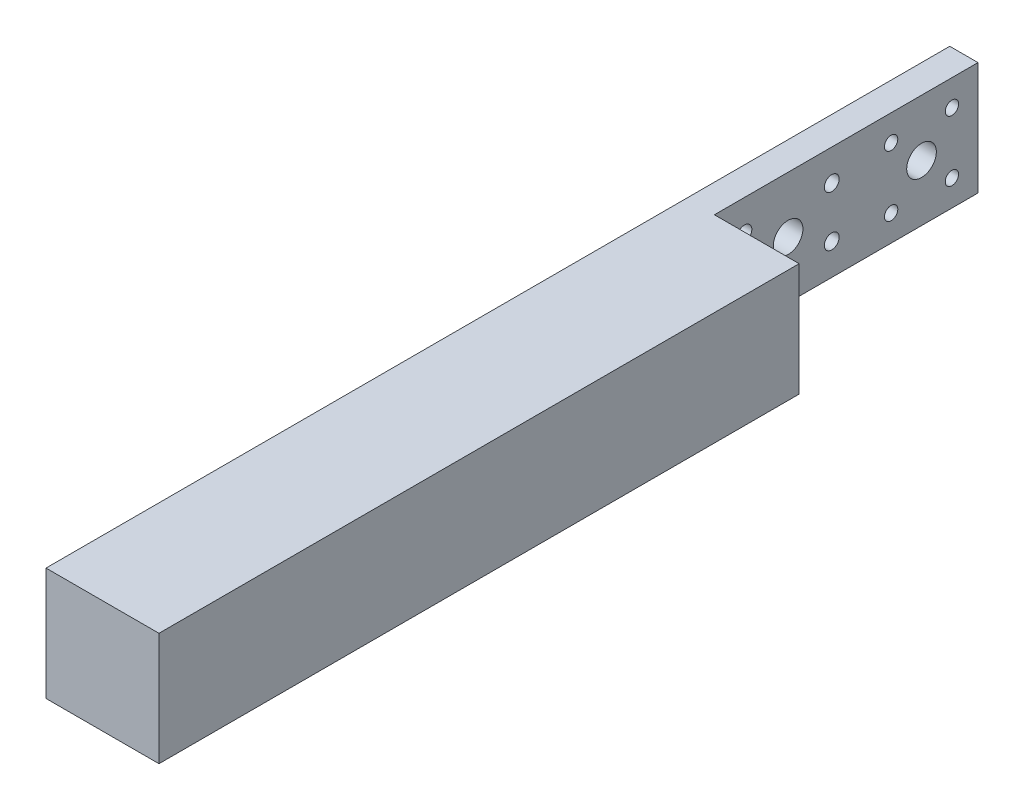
ISO-10303-21;
HEADER;
FILE_DESCRIPTION(('STEP AP214'),'2;1');
FILE_NAME('part.step','',(''),(''),'','','');
FILE_SCHEMA(('AUTOMOTIVE_DESIGN { 1 0 10303 214 1 1 1 1 }'));
ENDSEC;
DATA;
#1=APPLICATION_CONTEXT('core data for automotive mechanical design processes');
#2=APPLICATION_PROTOCOL_DEFINITION('international standard','automotive_design',2000,#1);
#3=PRODUCT_CONTEXT('',#1,'mechanical');
#4=PRODUCT('Part','Part','',(#3));
#5=PRODUCT_RELATED_PRODUCT_CATEGORY('part','',(#4));
#6=PRODUCT_DEFINITION_FORMATION('','',#4);
#7=PRODUCT_DEFINITION_CONTEXT('part definition',#1,'design');
#8=PRODUCT_DEFINITION('design','',#6,#7);
#9=PRODUCT_DEFINITION_SHAPE('','',#8);
#10=(LENGTH_UNIT() NAMED_UNIT(*) SI_UNIT(.MILLI.,.METRE.));
#11=(NAMED_UNIT(*) PLANE_ANGLE_UNIT() SI_UNIT($,.RADIAN.));
#12=(NAMED_UNIT(*) SI_UNIT($,.STERADIAN.) SOLID_ANGLE_UNIT());
#13=UNCERTAINTY_MEASURE_WITH_UNIT(LENGTH_MEASURE(1.E-05),#10,'distance_accuracy_value','');
#14=(GEOMETRIC_REPRESENTATION_CONTEXT(3) GLOBAL_UNCERTAINTY_ASSIGNED_CONTEXT((#13)) GLOBAL_UNIT_ASSIGNED_CONTEXT((#10,
#11,#12)) REPRESENTATION_CONTEXT('',''));
#15=CARTESIAN_POINT('',(0.,0.,0.));
#16=DIRECTION('',(0.,0.,1.));
#17=DIRECTION('',(1.,0.,0.));
#18=AXIS2_PLACEMENT_3D('',#15,#16,#17);
#19=CARTESIAN_POINT('',(19.05,19.05,304.8));
#20=DIRECTION('',(-1.,0.,0.));
#21=DIRECTION('',(0.,-1.,0.));
#22=AXIS2_PLACEMENT_3D('',#19,#20,#21);
#23=PLANE('',#22);
#24=DIRECTION('',(0.,0.,-1.));
#25=VECTOR('',#24,1.);
#26=CARTESIAN_POINT('',(19.05,-19.05,304.8));
#27=LINE('',#26,#25);
#28=CARTESIAN_POINT('',(19.05,-19.05,304.8));
#29=VERTEX_POINT('',#28);
#30=CARTESIAN_POINT('',(19.05,-19.05,88.9));
#31=VERTEX_POINT('',#30);
#32=EDGE_CURVE('E125',#29,#31,#27,.T.);
#33=ORIENTED_EDGE('',*,*,#32,.T.);
#34=DIRECTION('',(0.,-1.,0.));
#35=VECTOR('',#34,1.);
#36=CARTESIAN_POINT('',(19.05,19.05,88.9));
#37=LINE('',#36,#35);
#38=CARTESIAN_POINT('',(19.05,19.05,88.9));
#39=VERTEX_POINT('',#38);
#40=EDGE_CURVE('E105',#39,#31,#37,.T.);
#41=ORIENTED_EDGE('',*,*,#40,.F.);
#42=DIRECTION('',(0.,0.,-1.));
#43=VECTOR('',#42,1.);
#44=CARTESIAN_POINT('',(19.05,19.05,304.8));
#45=LINE('',#44,#43);
#46=CARTESIAN_POINT('',(19.05,19.05,304.8));
#47=VERTEX_POINT('',#46);
#48=EDGE_CURVE('E11',#47,#39,#45,.T.);
#49=ORIENTED_EDGE('',*,*,#48,.F.);
#50=DIRECTION('',(0.,1.,0.));
#51=VECTOR('',#50,1.);
#52=CARTESIAN_POINT('',(19.05,19.05,304.8));
#53=LINE('',#52,#51);
#54=EDGE_CURVE('E124',#29,#47,#53,.T.);
#55=ORIENTED_EDGE('',*,*,#54,.F.);
#56=EDGE_LOOP('',(#33,#41,#49,#55));
#57=FACE_BOUND('',#56,.T.);
#58=ADVANCED_FACE('F33',(#57),#23,.F.);
#59=CARTESIAN_POINT('',(-19.05,19.05,304.8));
#60=DIRECTION('',(0.,-1.,0.));
#61=DIRECTION('',(0.,0.,-1.));
#62=AXIS2_PLACEMENT_3D('',#59,#60,#61);
#63=PLANE('',#62);
#64=ORIENTED_EDGE('',*,*,#48,.T.);
#65=DIRECTION('',(1.,0.,0.));
#66=VECTOR('',#65,1.);
#67=CARTESIAN_POINT('',(-9.525,19.05,88.9));
#68=LINE('',#67,#66);
#69=CARTESIAN_POINT('',(-9.525,19.05,88.9));
#70=VERTEX_POINT('',#69);
#71=EDGE_CURVE('E109',#70,#39,#68,.T.);
#72=ORIENTED_EDGE('',*,*,#71,.F.);
#73=DIRECTION('',(0.,0.,1.));
#74=VECTOR('',#73,1.);
#75=CARTESIAN_POINT('',(-9.525,19.05,0.));
#76=LINE('',#75,#74);
#77=CARTESIAN_POINT('',(-9.525,19.05,0.));
#78=VERTEX_POINT('',#77);
#79=EDGE_CURVE('E99',#78,#70,#76,.T.);
#80=ORIENTED_EDGE('',*,*,#79,.F.);
#81=DIRECTION('',(-1.,0.,0.));
#82=VECTOR('',#81,1.);
#83=CARTESIAN_POINT('',(-19.05,19.05,0.));
#84=LINE('',#83,#82);
#85=CARTESIAN_POINT('',(-19.05,19.05,0.));
#86=VERTEX_POINT('',#85);
#87=EDGE_CURVE('E108',#78,#86,#84,.T.);
#88=ORIENTED_EDGE('',*,*,#87,.T.);
#89=DIRECTION('',(0.,0.,-1.));
#90=VECTOR('',#89,1.);
#91=CARTESIAN_POINT('',(-19.05,19.05,304.8));
#92=LINE('',#91,#90);
#93=CARTESIAN_POINT('',(-19.05,19.05,304.8));
#94=VERTEX_POINT('',#93);
#95=EDGE_CURVE('E41',#94,#86,#92,.T.);
#96=ORIENTED_EDGE('',*,*,#95,.F.);
#97=DIRECTION('',(-1.,0.,0.));
#98=VECTOR('',#97,1.);
#99=CARTESIAN_POINT('',(-19.05,19.05,304.8));
#100=LINE('',#99,#98);
#101=EDGE_CURVE('E80',#47,#94,#100,.T.);
#102=ORIENTED_EDGE('',*,*,#101,.F.);
#103=EDGE_LOOP('',(#64,#72,#80,#88,#96,#102));
#104=FACE_BOUND('',#103,.T.);
#105=ADVANCED_FACE('F107',(#104),#63,.F.);
#106=CARTESIAN_POINT('',(-19.05,19.05,304.8));
#107=DIRECTION('',(1.,0.,0.));
#108=DIRECTION('',(0.,1.,0.));
#109=AXIS2_PLACEMENT_3D('',#106,#107,#108);
#110=PLANE('',#109);
#111=CARTESIAN_POINT('',(-19.05,10.253048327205,8.79695167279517));
#112=DIRECTION('',(1.,0.,0.));
#113=DIRECTION('',(0.,0.,-1.));
#114=AXIS2_PLACEMENT_3D('',#111,#112,#113);
#115=CIRCLE('',#114,2.25);
#116=CARTESIAN_POINT('',(-19.05,10.2530483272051,6.54695167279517));
#117=VERTEX_POINT('',#116);
#118=EDGE_CURVE('E159',#117,#117,#115,.T.);
#119=ORIENTED_EDGE('',*,*,#118,.T.);
#120=EDGE_LOOP('',(#119));
#121=FACE_BOUND('',#120,.T.);
#122=CARTESIAN_POINT('',(-19.05,-10.2530483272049,8.79695167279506));
#123=DIRECTION('',(1.,0.,0.));
#124=DIRECTION('',(0.,-1.,0.));
#125=AXIS2_PLACEMENT_3D('',#122,#123,#124);
#126=CIRCLE('',#125,2.25);
#127=CARTESIAN_POINT('',(-19.05,-12.5030483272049,8.79695167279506));
#128=VERTEX_POINT('',#127);
#129=EDGE_CURVE('E156',#128,#128,#126,.T.);
#130=ORIENTED_EDGE('',*,*,#129,.T.);
#131=EDGE_LOOP('',(#130));
#132=FACE_BOUND('',#131,.T.);
#133=CARTESIAN_POINT('',(-19.05,-10.253048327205,29.3030483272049));
#134=DIRECTION('',(1.,0.,0.));
#135=DIRECTION('',(0.,0.,1.));
#136=AXIS2_PLACEMENT_3D('',#133,#134,#135);
#137=CIRCLE('',#136,2.25);
#138=CARTESIAN_POINT('',(-19.05,-10.253048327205,31.5530483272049));
#139=VERTEX_POINT('',#138);
#140=EDGE_CURVE('E153',#139,#139,#137,.T.);
#141=ORIENTED_EDGE('',*,*,#140,.T.);
#142=EDGE_LOOP('',(#141));
#143=FACE_BOUND('',#142,.T.);
#144=CARTESIAN_POINT('',(-19.05,10.2530483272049,29.3030483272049));
#145=DIRECTION('',(1.,0.,0.));
#146=DIRECTION('',(0.,1.,0.));
#147=AXIS2_PLACEMENT_3D('',#144,#145,#146);
#148=CIRCLE('',#147,2.25);
#149=CARTESIAN_POINT('',(-19.05,12.5030483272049,29.3030483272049));
#150=VERTEX_POINT('',#149);
#151=EDGE_CURVE('E150',#150,#150,#148,.T.);
#152=ORIENTED_EDGE('',*,*,#151,.T.);
#153=EDGE_LOOP('',(#152));
#154=FACE_BOUND('',#153,.T.);
#155=CARTESIAN_POINT('',(-19.05,8.50000000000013,49.3275681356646));
#156=DIRECTION('',(1.,0.,0.));
#157=DIRECTION('',(0.,-0.499999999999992,-0.866025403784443));
#158=AXIS2_PLACEMENT_3D('',#155,#156,#157);
#159=CIRCLE('',#158,2.49999999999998);
#160=CARTESIAN_POINT('',(-19.05,7.25000000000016,47.1625046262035));
#161=VERTEX_POINT('',#160);
#162=EDGE_CURVE('E147',#161,#161,#159,.T.);
#163=ORIENTED_EDGE('',*,*,#162,.T.);
#164=EDGE_LOOP('',(#163));
#165=FACE_BOUND('',#164,.T.);
#166=CARTESIAN_POINT('',(-19.05,-8.50000000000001,49.3275681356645));
#167=DIRECTION('',(1.,0.,0.));
#168=DIRECTION('',(0.,-1.,0.));
#169=AXIS2_PLACEMENT_3D('',#166,#167,#168);
#170=CIRCLE('',#169,2.49999999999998);
#171=CARTESIAN_POINT('',(-19.05,-11.,49.3275681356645));
#172=VERTEX_POINT('',#171);
#173=EDGE_CURVE('E144',#172,#172,#170,.T.);
#174=ORIENTED_EDGE('',*,*,#173,.T.);
#175=EDGE_LOOP('',(#174));
#176=FACE_BOUND('',#175,.T.);
#177=CARTESIAN_POINT('',(-19.05,-8.50000000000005,78.7724318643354));
#178=DIRECTION('',(1.,0.,0.));
#179=DIRECTION('',(0.,0.499999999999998,0.86602540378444));
#180=AXIS2_PLACEMENT_3D('',#177,#178,#179);
#181=CIRCLE('',#180,2.49999999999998);
#182=CARTESIAN_POINT('',(-19.05,-7.25000000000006,80.9374953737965));
#183=VERTEX_POINT('',#182);
#184=EDGE_CURVE('E141',#183,#183,#181,.T.);
#185=ORIENTED_EDGE('',*,*,#184,.T.);
#186=EDGE_LOOP('',(#185));
#187=FACE_BOUND('',#186,.T.);
#188=CARTESIAN_POINT('',(-19.05,8.5,78.7724318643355));
#189=DIRECTION('',(1.,0.,0.));
#190=DIRECTION('',(0.,1.,0.));
#191=AXIS2_PLACEMENT_3D('',#188,#189,#190);
#192=CIRCLE('',#191,2.49999999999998);
#193=CARTESIAN_POINT('',(-19.05,11.,78.7724318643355));
#194=VERTEX_POINT('',#193);
#195=EDGE_CURVE('E138',#194,#194,#192,.T.);
#196=ORIENTED_EDGE('',*,*,#195,.T.);
#197=EDGE_LOOP('',(#196));
#198=FACE_BOUND('',#197,.T.);
#199=CARTESIAN_POINT('',(-19.05,0.,64.05));
#200=DIRECTION('',(1.,0.,0.));
#201=DIRECTION('',(0.,1.,0.));
#202=AXIS2_PLACEMENT_3D('',#199,#200,#201);
#203=CIRCLE('',#202,5.);
#204=CARTESIAN_POINT('',(-19.05,5.,64.05));
#205=VERTEX_POINT('',#204);
#206=EDGE_CURVE('E118',#205,#205,#203,.T.);
#207=ORIENTED_EDGE('',*,*,#206,.T.);
#208=EDGE_LOOP('',(#207));
#209=FACE_BOUND('',#208,.T.);
#210=CARTESIAN_POINT('',(-19.05,0.,19.05));
#211=DIRECTION('',(1.,0.,0.));
#212=DIRECTION('',(0.,1.,0.));
#213=AXIS2_PLACEMENT_3D('',#210,#211,#212);
#214=CIRCLE('',#213,5.);
#215=CARTESIAN_POINT('',(-19.05,5.,19.05));
#216=VERTEX_POINT('',#215);
#217=EDGE_CURVE('E113',#216,#216,#214,.T.);
#218=ORIENTED_EDGE('',*,*,#217,.T.);
#219=EDGE_LOOP('',(#218));
#220=FACE_BOUND('',#219,.T.);
#221=DIRECTION('',(0.,-1.,0.));
#222=VECTOR('',#221,1.);
#223=CARTESIAN_POINT('',(-19.05,19.05,0.));
#224=LINE('',#223,#222);
#225=CARTESIAN_POINT('',(-19.05,-19.05,0.));
#226=VERTEX_POINT('',#225);
#227=EDGE_CURVE('E73',#86,#226,#224,.T.);
#228=ORIENTED_EDGE('',*,*,#227,.T.);
#229=DIRECTION('',(0.,0.,-1.));
#230=VECTOR('',#229,1.);
#231=CARTESIAN_POINT('',(-19.05,-19.05,304.8));
#232=LINE('',#231,#230);
#233=CARTESIAN_POINT('',(-19.05,-19.05,304.8));
#234=VERTEX_POINT('',#233);
#235=EDGE_CURVE('E128',#234,#226,#232,.T.);
#236=ORIENTED_EDGE('',*,*,#235,.F.);
#237=DIRECTION('',(0.,-1.,0.));
#238=VECTOR('',#237,1.);
#239=CARTESIAN_POINT('',(-19.05,19.05,304.8));
#240=LINE('',#239,#238);
#241=EDGE_CURVE('E132',#94,#234,#240,.T.);
#242=ORIENTED_EDGE('',*,*,#241,.F.);
#243=ORIENTED_EDGE('',*,*,#95,.T.);
#244=EDGE_LOOP('',(#228,#236,#242,#243));
#245=FACE_BOUND('',#244,.T.);
#246=ADVANCED_FACE('F131',(#121,#132,#143,#154,#165,#176,#187,#198,#209,#220,#245),#110,.F.);
#247=CARTESIAN_POINT('',(-19.05,-19.05,304.8));
#248=DIRECTION('',(0.,1.,0.));
#249=DIRECTION('',(0.,0.,1.));
#250=AXIS2_PLACEMENT_3D('',#247,#248,#249);
#251=PLANE('',#250);
#252=DIRECTION('',(0.,0.,-1.));
#253=VECTOR('',#252,1.);
#254=CARTESIAN_POINT('',(-9.52499999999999,-19.05,0.));
#255=LINE('',#254,#253);
#256=CARTESIAN_POINT('',(-9.52499999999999,-19.05,88.9));
#257=VERTEX_POINT('',#256);
#258=CARTESIAN_POINT('',(-9.525,-19.05,0.));
#259=VERTEX_POINT('',#258);
#260=EDGE_CURVE('E48',#257,#259,#255,.T.);
#261=ORIENTED_EDGE('',*,*,#260,.F.);
#262=DIRECTION('',(1.,0.,0.));
#263=VECTOR('',#262,1.);
#264=CARTESIAN_POINT('',(-9.52499999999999,-19.05,88.9));
#265=LINE('',#264,#263);
#266=EDGE_CURVE('E190',#257,#31,#265,.T.);
#267=ORIENTED_EDGE('',*,*,#266,.T.);
#268=ORIENTED_EDGE('',*,*,#32,.F.);
#269=DIRECTION('',(1.,0.,0.));
#270=VECTOR('',#269,1.);
#271=CARTESIAN_POINT('',(-19.05,-19.05,304.8));
#272=LINE('',#271,#270);
#273=EDGE_CURVE('E57',#234,#29,#272,.T.);
#274=ORIENTED_EDGE('',*,*,#273,.F.);
#275=ORIENTED_EDGE('',*,*,#235,.T.);
#276=DIRECTION('',(1.,0.,0.));
#277=VECTOR('',#276,1.);
#278=CARTESIAN_POINT('',(-19.05,-19.05,0.));
#279=LINE('',#278,#277);
#280=EDGE_CURVE('E115',#226,#259,#279,.T.);
#281=ORIENTED_EDGE('',*,*,#280,.T.);
#282=EDGE_LOOP('',(#261,#267,#268,#274,#275,#281));
#283=FACE_BOUND('',#282,.T.);
#284=ADVANCED_FACE('F197',(#283),#251,.F.);
#285=CARTESIAN_POINT('',(0.,0.,304.8));
#286=DIRECTION('',(0.,0.,1.));
#287=DIRECTION('',(1.,0.,0.));
#288=AXIS2_PLACEMENT_3D('',#285,#286,#287);
#289=PLANE('',#288);
#290=ORIENTED_EDGE('',*,*,#54,.T.);
#291=ORIENTED_EDGE('',*,*,#101,.T.);
#292=ORIENTED_EDGE('',*,*,#241,.T.);
#293=ORIENTED_EDGE('',*,*,#273,.T.);
#294=EDGE_LOOP('',(#290,#291,#292,#293));
#295=FACE_BOUND('',#294,.T.);
#296=ADVANCED_FACE('F202',(#295),#289,.T.);
#297=CARTESIAN_POINT('',(0.,0.,0.));
#298=DIRECTION('',(0.,0.,1.));
#299=DIRECTION('',(1.,0.,0.));
#300=AXIS2_PLACEMENT_3D('',#297,#298,#299);
#301=PLANE('',#300);
#302=ORIENTED_EDGE('',*,*,#87,.F.);
#303=DIRECTION('',(0.,1.,0.));
#304=VECTOR('',#303,1.);
#305=CARTESIAN_POINT('',(-9.525,19.05,0.));
#306=LINE('',#305,#304);
#307=EDGE_CURVE('E95',#259,#78,#306,.T.);
#308=ORIENTED_EDGE('',*,*,#307,.F.);
#309=ORIENTED_EDGE('',*,*,#280,.F.);
#310=ORIENTED_EDGE('',*,*,#227,.F.);
#311=EDGE_LOOP('',(#302,#308,#309,#310));
#312=FACE_BOUND('',#311,.T.);
#313=ADVANCED_FACE('F112',(#312),#301,.F.);
#314=CARTESIAN_POINT('',(-19.05,0.,19.05));
#315=DIRECTION('',(1.,0.,0.));
#316=DIRECTION('',(0.,1.,0.));
#317=AXIS2_PLACEMENT_3D('',#314,#315,#316);
#318=CYLINDRICAL_SURFACE('',#317,5.);
#319=CARTESIAN_POINT('',(-9.525,0.,19.05));
#320=DIRECTION('',(-1.,0.,0.));
#321=DIRECTION('',(0.,-1.,0.));
#322=AXIS2_PLACEMENT_3D('',#319,#320,#321);
#323=CIRCLE('',#322,5.);
#324=CARTESIAN_POINT('',(-9.52499999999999,-5.,19.05));
#325=VERTEX_POINT('',#324);
#326=EDGE_CURVE('E162',#325,#325,#323,.F.);
#327=ORIENTED_EDGE('',*,*,#326,.T.);
#328=EDGE_LOOP('',(#327));
#329=FACE_BOUND('',#328,.T.);
#330=ORIENTED_EDGE('',*,*,#217,.F.);
#331=EDGE_LOOP('',(#330));
#332=FACE_BOUND('',#331,.T.);
#333=ADVANCED_FACE('F209',(#329,#332),#318,.F.);
#334=CARTESIAN_POINT('',(-19.05,0.,64.05));
#335=DIRECTION('',(1.,0.,0.));
#336=DIRECTION('',(0.,1.,0.));
#337=AXIS2_PLACEMENT_3D('',#334,#335,#336);
#338=CYLINDRICAL_SURFACE('',#337,5.);
#339=CARTESIAN_POINT('',(-9.525,0.,64.05));
#340=DIRECTION('',(-1.,0.,0.));
#341=DIRECTION('',(0.,-1.,0.));
#342=AXIS2_PLACEMENT_3D('',#339,#340,#341);
#343=CIRCLE('',#342,5.);
#344=CARTESIAN_POINT('',(-9.52499999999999,-5.00000000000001,64.05));
#345=VERTEX_POINT('',#344);
#346=EDGE_CURVE('E165',#345,#345,#343,.F.);
#347=ORIENTED_EDGE('',*,*,#346,.T.);
#348=EDGE_LOOP('',(#347));
#349=FACE_BOUND('',#348,.T.);
#350=ORIENTED_EDGE('',*,*,#206,.F.);
#351=EDGE_LOOP('',(#350));
#352=FACE_BOUND('',#351,.T.);
#353=ADVANCED_FACE('F245',(#349,#352),#338,.F.);
#354=CARTESIAN_POINT('',(-19.05,8.5,78.7724318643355));
#355=DIRECTION('',(1.,0.,0.));
#356=DIRECTION('',(0.,1.,0.));
#357=AXIS2_PLACEMENT_3D('',#354,#355,#356);
#358=CYLINDRICAL_SURFACE('',#357,2.49999999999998);
#359=CARTESIAN_POINT('',(-9.525,8.50000000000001,78.7724318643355));
#360=DIRECTION('',(-1.,0.,0.));
#361=DIRECTION('',(0.,-1.,0.));
#362=AXIS2_PLACEMENT_3D('',#359,#360,#361);
#363=CIRCLE('',#362,2.49999999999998);
#364=CARTESIAN_POINT('',(-9.525,6.00000000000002,78.7724318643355));
#365=VERTEX_POINT('',#364);
#366=EDGE_CURVE('E168',#365,#365,#363,.F.);
#367=ORIENTED_EDGE('',*,*,#366,.T.);
#368=EDGE_LOOP('',(#367));
#369=FACE_BOUND('',#368,.T.);
#370=ORIENTED_EDGE('',*,*,#195,.F.);
#371=EDGE_LOOP('',(#370));
#372=FACE_BOUND('',#371,.T.);
#373=ADVANCED_FACE('F250',(#369,#372),#358,.F.);
#374=CARTESIAN_POINT('',(-19.05,-8.50000000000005,78.7724318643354));
#375=DIRECTION('',(1.,0.,0.));
#376=DIRECTION('',(0.,1.,0.));
#377=AXIS2_PLACEMENT_3D('',#374,#375,#376);
#378=CYLINDRICAL_SURFACE('',#377,2.49999999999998);
#379=CARTESIAN_POINT('',(-9.52499999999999,-8.50000000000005,78.7724318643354));
#380=DIRECTION('',(-1.,0.,0.));
#381=DIRECTION('',(0.,-1.,0.));
#382=AXIS2_PLACEMENT_3D('',#379,#380,#381);
#383=CIRCLE('',#382,2.49999999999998);
#384=CARTESIAN_POINT('',(-9.52499999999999,-11.,78.7724318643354));
#385=VERTEX_POINT('',#384);
#386=EDGE_CURVE('E171',#385,#385,#383,.F.);
#387=ORIENTED_EDGE('',*,*,#386,.T.);
#388=EDGE_LOOP('',(#387));
#389=FACE_BOUND('',#388,.T.);
#390=ORIENTED_EDGE('',*,*,#184,.F.);
#391=EDGE_LOOP('',(#390));
#392=FACE_BOUND('',#391,.T.);
#393=ADVANCED_FACE('F256',(#389,#392),#378,.F.);
#394=CARTESIAN_POINT('',(-19.05,-8.50000000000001,49.3275681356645));
#395=DIRECTION('',(1.,0.,0.));
#396=DIRECTION('',(0.,1.,0.));
#397=AXIS2_PLACEMENT_3D('',#394,#395,#396);
#398=CYLINDRICAL_SURFACE('',#397,2.49999999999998);
#399=CARTESIAN_POINT('',(-9.52499999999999,-8.50000000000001,49.3275681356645));
#400=DIRECTION('',(-1.,0.,0.));
#401=DIRECTION('',(0.,-1.,0.));
#402=AXIS2_PLACEMENT_3D('',#399,#400,#401);
#403=CIRCLE('',#402,2.49999999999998);
#404=CARTESIAN_POINT('',(-9.52499999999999,-11.,49.3275681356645));
#405=VERTEX_POINT('',#404);
#406=EDGE_CURVE('E174',#405,#405,#403,.F.);
#407=ORIENTED_EDGE('',*,*,#406,.T.);
#408=EDGE_LOOP('',(#407));
#409=FACE_BOUND('',#408,.T.);
#410=ORIENTED_EDGE('',*,*,#173,.F.);
#411=EDGE_LOOP('',(#410));
#412=FACE_BOUND('',#411,.T.);
#413=ADVANCED_FACE('F260',(#409,#412),#398,.F.);
#414=CARTESIAN_POINT('',(-19.05,8.50000000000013,49.3275681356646));
#415=DIRECTION('',(1.,0.,0.));
#416=DIRECTION('',(0.,1.,0.));
#417=AXIS2_PLACEMENT_3D('',#414,#415,#416);
#418=CYLINDRICAL_SURFACE('',#417,2.49999999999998);
#419=CARTESIAN_POINT('',(-9.525,8.50000000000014,49.3275681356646));
#420=DIRECTION('',(-1.,0.,0.));
#421=DIRECTION('',(0.,-1.,0.));
#422=AXIS2_PLACEMENT_3D('',#419,#420,#421);
#423=CIRCLE('',#422,2.49999999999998);
#424=CARTESIAN_POINT('',(-9.525,6.00000000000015,49.3275681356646));
#425=VERTEX_POINT('',#424);
#426=EDGE_CURVE('E177',#425,#425,#423,.F.);
#427=ORIENTED_EDGE('',*,*,#426,.T.);
#428=EDGE_LOOP('',(#427));
#429=FACE_BOUND('',#428,.T.);
#430=ORIENTED_EDGE('',*,*,#162,.F.);
#431=EDGE_LOOP('',(#430));
#432=FACE_BOUND('',#431,.T.);
#433=ADVANCED_FACE('F264',(#429,#432),#418,.F.);
#434=CARTESIAN_POINT('',(-19.05,10.2530483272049,29.3030483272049));
#435=DIRECTION('',(1.,0.,0.));
#436=DIRECTION('',(0.,1.,0.));
#437=AXIS2_PLACEMENT_3D('',#434,#435,#436);
#438=CYLINDRICAL_SURFACE('',#437,2.25);
#439=CARTESIAN_POINT('',(-9.525,10.2530483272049,29.3030483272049));
#440=DIRECTION('',(-1.,0.,0.));
#441=DIRECTION('',(0.,-1.,0.));
#442=AXIS2_PLACEMENT_3D('',#439,#440,#441);
#443=CIRCLE('',#442,2.25);
#444=CARTESIAN_POINT('',(-9.525,8.00304832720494,29.3030483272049));
#445=VERTEX_POINT('',#444);
#446=EDGE_CURVE('E180',#445,#445,#443,.F.);
#447=ORIENTED_EDGE('',*,*,#446,.T.);
#448=EDGE_LOOP('',(#447));
#449=FACE_BOUND('',#448,.T.);
#450=ORIENTED_EDGE('',*,*,#151,.F.);
#451=EDGE_LOOP('',(#450));
#452=FACE_BOUND('',#451,.T.);
#453=ADVANCED_FACE('F268',(#449,#452),#438,.F.);
#454=CARTESIAN_POINT('',(-19.05,-10.253048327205,29.3030483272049));
#455=DIRECTION('',(1.,0.,0.));
#456=DIRECTION('',(0.,1.,0.));
#457=AXIS2_PLACEMENT_3D('',#454,#455,#456);
#458=CYLINDRICAL_SURFACE('',#457,2.25);
#459=CARTESIAN_POINT('',(-9.52499999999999,-10.253048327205,29.3030483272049));
#460=DIRECTION('',(-1.,0.,0.));
#461=DIRECTION('',(0.,-1.,0.));
#462=AXIS2_PLACEMENT_3D('',#459,#460,#461);
#463=CIRCLE('',#462,2.25);
#464=CARTESIAN_POINT('',(-9.52499999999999,-12.503048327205,29.3030483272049));
#465=VERTEX_POINT('',#464);
#466=EDGE_CURVE('E183',#465,#465,#463,.F.);
#467=ORIENTED_EDGE('',*,*,#466,.T.);
#468=EDGE_LOOP('',(#467));
#469=FACE_BOUND('',#468,.T.);
#470=ORIENTED_EDGE('',*,*,#140,.F.);
#471=EDGE_LOOP('',(#470));
#472=FACE_BOUND('',#471,.T.);
#473=ADVANCED_FACE('F272',(#469,#472),#458,.F.);
#474=CARTESIAN_POINT('',(-19.05,-10.2530483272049,8.79695167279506));
#475=DIRECTION('',(1.,0.,0.));
#476=DIRECTION('',(0.,1.,0.));
#477=AXIS2_PLACEMENT_3D('',#474,#475,#476);
#478=CYLINDRICAL_SURFACE('',#477,2.25);
#479=CARTESIAN_POINT('',(-9.52499999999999,-10.2530483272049,8.79695167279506));
#480=DIRECTION('',(-1.,0.,0.));
#481=DIRECTION('',(0.,-1.,0.));
#482=AXIS2_PLACEMENT_3D('',#479,#480,#481);
#483=CIRCLE('',#482,2.25);
#484=CARTESIAN_POINT('',(-9.52499999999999,-12.5030483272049,8.79695167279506));
#485=VERTEX_POINT('',#484);
#486=EDGE_CURVE('E186',#485,#485,#483,.F.);
#487=ORIENTED_EDGE('',*,*,#486,.T.);
#488=EDGE_LOOP('',(#487));
#489=FACE_BOUND('',#488,.T.);
#490=ORIENTED_EDGE('',*,*,#129,.F.);
#491=EDGE_LOOP('',(#490));
#492=FACE_BOUND('',#491,.T.);
#493=ADVANCED_FACE('F276',(#489,#492),#478,.F.);
#494=CARTESIAN_POINT('',(-19.05,10.253048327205,8.79695167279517));
#495=DIRECTION('',(1.,0.,0.));
#496=DIRECTION('',(0.,1.,0.));
#497=AXIS2_PLACEMENT_3D('',#494,#495,#496);
#498=CYLINDRICAL_SURFACE('',#497,2.25);
#499=CARTESIAN_POINT('',(-9.525,10.253048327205,8.79695167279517));
#500=DIRECTION('',(-1.,0.,0.));
#501=DIRECTION('',(0.,-1.,0.));
#502=AXIS2_PLACEMENT_3D('',#499,#500,#501);
#503=CIRCLE('',#502,2.25);
#504=CARTESIAN_POINT('',(-9.525,8.00304832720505,8.79695167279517));
#505=VERTEX_POINT('',#504);
#506=EDGE_CURVE('E36',#505,#505,#503,.F.);
#507=ORIENTED_EDGE('',*,*,#506,.T.);
#508=EDGE_LOOP('',(#507));
#509=FACE_BOUND('',#508,.T.);
#510=ORIENTED_EDGE('',*,*,#118,.F.);
#511=EDGE_LOOP('',(#510));
#512=FACE_BOUND('',#511,.T.);
#513=ADVANCED_FACE('F280',(#509,#512),#498,.F.);
#514=CARTESIAN_POINT('',(-9.525,0.,0.));
#515=DIRECTION('',(-1.,0.,0.));
#516=DIRECTION('',(0.,-1.,0.));
#517=AXIS2_PLACEMENT_3D('',#514,#515,#516);
#518=PLANE('',#517);
#519=ORIENTED_EDGE('',*,*,#346,.F.);
#520=EDGE_LOOP('',(#519));
#521=FACE_BOUND('',#520,.T.);
#522=ORIENTED_EDGE('',*,*,#386,.F.);
#523=EDGE_LOOP('',(#522));
#524=FACE_BOUND('',#523,.T.);
#525=ORIENTED_EDGE('',*,*,#426,.F.);
#526=EDGE_LOOP('',(#525));
#527=FACE_BOUND('',#526,.T.);
#528=ORIENTED_EDGE('',*,*,#466,.F.);
#529=EDGE_LOOP('',(#528));
#530=FACE_BOUND('',#529,.T.);
#531=ORIENTED_EDGE('',*,*,#506,.F.);
#532=EDGE_LOOP('',(#531));
#533=FACE_BOUND('',#532,.T.);
#534=ORIENTED_EDGE('',*,*,#307,.T.);
#535=ORIENTED_EDGE('',*,*,#79,.T.);
#536=DIRECTION('',(0.,-1.,0.));
#537=VECTOR('',#536,1.);
#538=CARTESIAN_POINT('',(-9.525,19.05,88.9));
#539=LINE('',#538,#537);
#540=EDGE_CURVE('E110',#70,#257,#539,.T.);
#541=ORIENTED_EDGE('',*,*,#540,.T.);
#542=ORIENTED_EDGE('',*,*,#260,.T.);
#543=EDGE_LOOP('',(#534,#535,#541,#542));
#544=FACE_BOUND('',#543,.T.);
#545=ORIENTED_EDGE('',*,*,#486,.F.);
#546=EDGE_LOOP('',(#545));
#547=FACE_BOUND('',#546,.T.);
#548=ORIENTED_EDGE('',*,*,#446,.F.);
#549=EDGE_LOOP('',(#548));
#550=FACE_BOUND('',#549,.T.);
#551=ORIENTED_EDGE('',*,*,#406,.F.);
#552=EDGE_LOOP('',(#551));
#553=FACE_BOUND('',#552,.T.);
#554=ORIENTED_EDGE('',*,*,#366,.F.);
#555=EDGE_LOOP('',(#554));
#556=FACE_BOUND('',#555,.T.);
#557=ORIENTED_EDGE('',*,*,#326,.F.);
#558=EDGE_LOOP('',(#557));
#559=FACE_BOUND('',#558,.T.);
#560=ADVANCED_FACE('F97',(#521,#524,#527,#530,#533,#544,#547,#550,#553,#556,#559),#518,.F.);
#561=CARTESIAN_POINT('',(-9.525,19.05,88.9));
#562=DIRECTION('',(0.,0.,1.));
#563=DIRECTION('',(1.,0.,0.));
#564=AXIS2_PLACEMENT_3D('',#561,#562,#563);
#565=PLANE('',#564);
#566=ORIENTED_EDGE('',*,*,#40,.T.);
#567=ORIENTED_EDGE('',*,*,#266,.F.);
#568=ORIENTED_EDGE('',*,*,#540,.F.);
#569=ORIENTED_EDGE('',*,*,#71,.T.);
#570=EDGE_LOOP('',(#566,#567,#568,#569));
#571=FACE_BOUND('',#570,.T.);
#572=ADVANCED_FACE('F285',(#571),#565,.F.);
#573=CLOSED_SHELL('',(#58,#105,#246,#284,#296,#313,#333,#353,#373,#393,#413,#433,#453,#473,#493,
#513,#560,#572));
#574=MANIFOLD_SOLID_BREP('B2',#573);
#575=ADVANCED_BREP_SHAPE_REPRESENTATION('',(#18,#574),#14);
#576=SHAPE_DEFINITION_REPRESENTATION(#9,#575);
ENDSEC;
END-ISO-10303-21;
